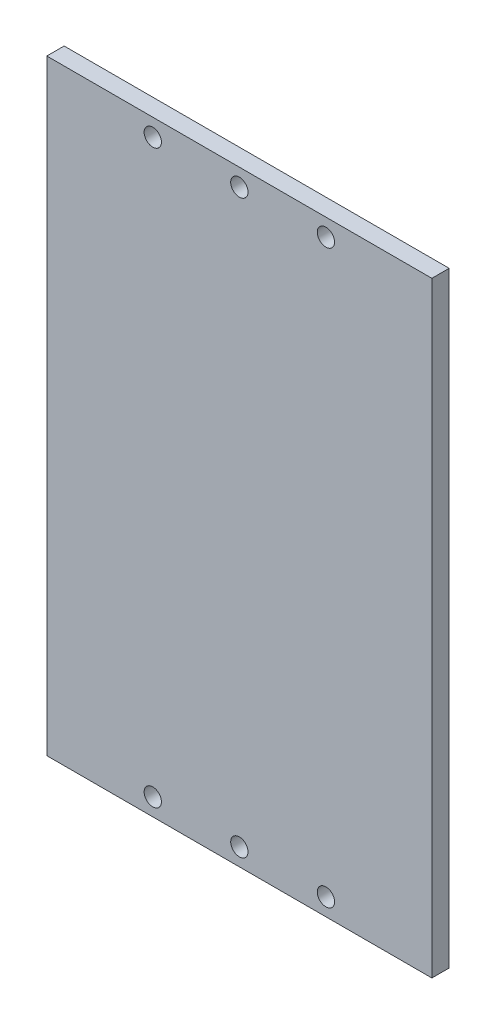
ISO-10303-21;
HEADER;
FILE_DESCRIPTION(('STEP AP214'),'2;1');
FILE_NAME('part.step','',(''),(''),'','','');
FILE_SCHEMA(('AUTOMOTIVE_DESIGN { 1 0 10303 214 1 1 1 1 }'));
ENDSEC;
DATA;
#1=APPLICATION_CONTEXT('core data for automotive mechanical design processes');
#2=APPLICATION_PROTOCOL_DEFINITION('international standard','automotive_design',2000,#1);
#3=PRODUCT_CONTEXT('',#1,'mechanical');
#4=PRODUCT('Part','Part','',(#3));
#5=PRODUCT_RELATED_PRODUCT_CATEGORY('part','',(#4));
#6=PRODUCT_DEFINITION_FORMATION('','',#4);
#7=PRODUCT_DEFINITION_CONTEXT('part definition',#1,'design');
#8=PRODUCT_DEFINITION('design','',#6,#7);
#9=PRODUCT_DEFINITION_SHAPE('','',#8);
#10=(LENGTH_UNIT() NAMED_UNIT(*) SI_UNIT(.MILLI.,.METRE.));
#11=(NAMED_UNIT(*) PLANE_ANGLE_UNIT() SI_UNIT($,.RADIAN.));
#12=(NAMED_UNIT(*) SI_UNIT($,.STERADIAN.) SOLID_ANGLE_UNIT());
#13=UNCERTAINTY_MEASURE_WITH_UNIT(LENGTH_MEASURE(1.E-05),#10,'distance_accuracy_value','');
#14=(GEOMETRIC_REPRESENTATION_CONTEXT(3) GLOBAL_UNCERTAINTY_ASSIGNED_CONTEXT((#13)) GLOBAL_UNIT_ASSIGNED_CONTEXT((#10,
#11,#12)) REPRESENTATION_CONTEXT('',''));
#15=CARTESIAN_POINT('',(0.,0.,0.));
#16=DIRECTION('',(0.,0.,1.));
#17=DIRECTION('',(1.,0.,0.));
#18=AXIS2_PLACEMENT_3D('',#15,#16,#17);
#19=CARTESIAN_POINT('',(0.,0.,2.));
#20=DIRECTION('',(0.,0.,1.));
#21=DIRECTION('',(1.,0.,0.));
#22=AXIS2_PLACEMENT_3D('',#19,#20,#21);
#23=PLANE('',#22);
#24=CARTESIAN_POINT('',(-8.26999999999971,3.00000000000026,2.));
#25=DIRECTION('',(0.,0.,1.));
#26=DIRECTION('',(-1.,0.,0.));
#27=AXIS2_PLACEMENT_3D('',#24,#25,#26);
#28=CIRCLE('',#27,1.);
#29=CARTESIAN_POINT('',(-9.26999999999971,3.00000000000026,2.));
#30=VERTEX_POINT('',#29);
#31=EDGE_CURVE('E164',#30,#30,#28,.T.);
#32=ORIENTED_EDGE('',*,*,#31,.F.);
#33=EDGE_LOOP('',(#32));
#34=FACE_BOUND('',#33,.T.);
#35=CARTESIAN_POINT('',(-18.2699999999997,-62.9999999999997,2.));
#36=DIRECTION('',(0.,0.,1.));
#37=DIRECTION('',(1.,0.,0.));
#38=AXIS2_PLACEMENT_3D('',#35,#36,#37);
#39=CIRCLE('',#38,1.);
#40=CARTESIAN_POINT('',(-17.2699999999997,-62.9999999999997,2.));
#41=VERTEX_POINT('',#40);
#42=EDGE_CURVE('E148',#41,#41,#39,.T.);
#43=ORIENTED_EDGE('',*,*,#42,.F.);
#44=EDGE_LOOP('',(#43));
#45=FACE_BOUND('',#44,.T.);
#46=CARTESIAN_POINT('',(-8.26999999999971,-62.9999999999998,2.));
#47=DIRECTION('',(0.,0.,1.));
#48=DIRECTION('',(1.,0.,0.));
#49=AXIS2_PLACEMENT_3D('',#46,#47,#48);
#50=CIRCLE('',#49,1.);
#51=CARTESIAN_POINT('',(-7.26999999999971,-62.9999999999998,2.));
#52=VERTEX_POINT('',#51);
#53=EDGE_CURVE('E118',#52,#52,#50,.T.);
#54=ORIENTED_EDGE('',*,*,#53,.F.);
#55=EDGE_LOOP('',(#54));
#56=FACE_BOUND('',#55,.T.);
#57=DIRECTION('',(0.,-1.,0.));
#58=VECTOR('',#57,1.);
#59=CARTESIAN_POINT('',(-30.5099999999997,5.00000000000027,2.));
#60=LINE('',#59,#58);
#61=CARTESIAN_POINT('',(-30.5099999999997,5.00000000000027,2.));
#62=VERTEX_POINT('',#61);
#63=CARTESIAN_POINT('',(-30.5099999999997,-64.9999999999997,2.));
#64=VERTEX_POINT('',#63);
#65=EDGE_CURVE('E98',#62,#64,#60,.T.);
#66=ORIENTED_EDGE('',*,*,#65,.T.);
#67=DIRECTION('',(1.,0.,0.));
#68=VECTOR('',#67,1.);
#69=CARTESIAN_POINT('',(-30.5099999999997,-64.9999999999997,2.));
#70=LINE('',#69,#68);
#71=CARTESIAN_POINT('',(13.9700000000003,-64.9999999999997,2.));
#72=VERTEX_POINT('',#71);
#73=EDGE_CURVE('E93',#64,#72,#70,.T.);
#74=ORIENTED_EDGE('',*,*,#73,.T.);
#75=DIRECTION('',(0.,1.,0.));
#76=VECTOR('',#75,1.);
#77=CARTESIAN_POINT('',(13.9700000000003,5.00000000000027,2.));
#78=LINE('',#77,#76);
#79=CARTESIAN_POINT('',(13.9700000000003,5.00000000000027,2.));
#80=VERTEX_POINT('',#79);
#81=EDGE_CURVE('E96',#72,#80,#78,.T.);
#82=ORIENTED_EDGE('',*,*,#81,.T.);
#83=DIRECTION('',(-1.,0.,0.));
#84=VECTOR('',#83,1.);
#85=CARTESIAN_POINT('',(-30.5099999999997,5.00000000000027,2.));
#86=LINE('',#85,#84);
#87=EDGE_CURVE('E63',#80,#62,#86,.T.);
#88=ORIENTED_EDGE('',*,*,#87,.T.);
#89=EDGE_LOOP('',(#66,#74,#82,#88));
#90=FACE_BOUND('',#89,.T.);
#91=CARTESIAN_POINT('',(1.73000000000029,-62.9999999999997,2.));
#92=DIRECTION('',(0.,0.,1.));
#93=DIRECTION('',(1.,0.,0.));
#94=AXIS2_PLACEMENT_3D('',#91,#92,#93);
#95=CIRCLE('',#94,1.);
#96=CARTESIAN_POINT('',(2.73000000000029,-62.9999999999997,2.));
#97=VERTEX_POINT('',#96);
#98=EDGE_CURVE('E140',#97,#97,#95,.T.);
#99=ORIENTED_EDGE('',*,*,#98,.F.);
#100=EDGE_LOOP('',(#99));
#101=FACE_BOUND('',#100,.T.);
#102=CARTESIAN_POINT('',(1.73000000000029,3.00000000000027,2.));
#103=DIRECTION('',(0.,0.,1.));
#104=DIRECTION('',(-1.,0.,0.));
#105=AXIS2_PLACEMENT_3D('',#102,#103,#104);
#106=CIRCLE('',#105,1.);
#107=CARTESIAN_POINT('',(0.730000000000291,3.00000000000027,2.));
#108=VERTEX_POINT('',#107);
#109=EDGE_CURVE('E156',#108,#108,#106,.T.);
#110=ORIENTED_EDGE('',*,*,#109,.F.);
#111=EDGE_LOOP('',(#110));
#112=FACE_BOUND('',#111,.T.);
#113=CARTESIAN_POINT('',(-18.2699999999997,3.00000000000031,2.));
#114=DIRECTION('',(0.,0.,1.));
#115=DIRECTION('',(-1.,0.,0.));
#116=AXIS2_PLACEMENT_3D('',#113,#114,#115);
#117=CIRCLE('',#116,1.);
#118=CARTESIAN_POINT('',(-19.2699999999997,3.00000000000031,2.));
#119=VERTEX_POINT('',#118);
#120=EDGE_CURVE('E172',#119,#119,#117,.T.);
#121=ORIENTED_EDGE('',*,*,#120,.F.);
#122=EDGE_LOOP('',(#121));
#123=FACE_BOUND('',#122,.T.);
#124=ADVANCED_FACE('F45',(#34,#45,#56,#90,#101,#112,#123),#23,.T.);
#125=CARTESIAN_POINT('',(0.,0.,0.));
#126=DIRECTION('',(0.,0.,1.));
#127=DIRECTION('',(1.,0.,0.));
#128=AXIS2_PLACEMENT_3D('',#125,#126,#127);
#129=PLANE('',#128);
#130=DIRECTION('',(0.,-1.,0.));
#131=VECTOR('',#130,1.);
#132=CARTESIAN_POINT('',(-30.5099999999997,5.00000000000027,0.));
#133=LINE('',#132,#131);
#134=CARTESIAN_POINT('',(-30.5099999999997,5.00000000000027,0.));
#135=VERTEX_POINT('',#134);
#136=CARTESIAN_POINT('',(-30.5099999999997,-64.9999999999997,0.));
#137=VERTEX_POINT('',#136);
#138=EDGE_CURVE('E114',#135,#137,#133,.T.);
#139=ORIENTED_EDGE('',*,*,#138,.F.);
#140=DIRECTION('',(-1.,0.,0.));
#141=VECTOR('',#140,1.);
#142=CARTESIAN_POINT('',(-30.5099999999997,5.00000000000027,0.));
#143=LINE('',#142,#141);
#144=CARTESIAN_POINT('',(13.9700000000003,5.00000000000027,0.));
#145=VERTEX_POINT('',#144);
#146=EDGE_CURVE('E86',#145,#135,#143,.T.);
#147=ORIENTED_EDGE('',*,*,#146,.F.);
#148=DIRECTION('',(0.,1.,0.));
#149=VECTOR('',#148,1.);
#150=CARTESIAN_POINT('',(13.9700000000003,5.00000000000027,0.));
#151=LINE('',#150,#149);
#152=CARTESIAN_POINT('',(13.9700000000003,-64.9999999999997,0.));
#153=VERTEX_POINT('',#152);
#154=EDGE_CURVE('E80',#153,#145,#151,.T.);
#155=ORIENTED_EDGE('',*,*,#154,.F.);
#156=DIRECTION('',(1.,0.,0.));
#157=VECTOR('',#156,1.);
#158=CARTESIAN_POINT('',(-30.5099999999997,-64.9999999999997,0.));
#159=LINE('',#158,#157);
#160=EDGE_CURVE('E103',#137,#153,#159,.T.);
#161=ORIENTED_EDGE('',*,*,#160,.F.);
#162=EDGE_LOOP('',(#139,#147,#155,#161));
#163=FACE_BOUND('',#162,.T.);
#164=CARTESIAN_POINT('',(-8.26999999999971,-62.9999999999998,0.));
#165=DIRECTION('',(0.,0.,1.));
#166=DIRECTION('',(1.,0.,0.));
#167=AXIS2_PLACEMENT_3D('',#164,#165,#166);
#168=CIRCLE('',#167,1.);
#169=CARTESIAN_POINT('',(-7.26999999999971,-62.9999999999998,0.));
#170=VERTEX_POINT('',#169);
#171=EDGE_CURVE('E136',#170,#170,#168,.T.);
#172=ORIENTED_EDGE('',*,*,#171,.T.);
#173=EDGE_LOOP('',(#172));
#174=FACE_BOUND('',#173,.T.);
#175=CARTESIAN_POINT('',(1.73000000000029,-62.9999999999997,0.));
#176=DIRECTION('',(0.,0.,1.));
#177=DIRECTION('',(1.,0.,0.));
#178=AXIS2_PLACEMENT_3D('',#175,#176,#177);
#179=CIRCLE('',#178,1.);
#180=CARTESIAN_POINT('',(2.73000000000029,-62.9999999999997,0.));
#181=VERTEX_POINT('',#180);
#182=EDGE_CURVE('E144',#181,#181,#179,.T.);
#183=ORIENTED_EDGE('',*,*,#182,.T.);
#184=EDGE_LOOP('',(#183));
#185=FACE_BOUND('',#184,.T.);
#186=CARTESIAN_POINT('',(-18.2699999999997,-62.9999999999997,0.));
#187=DIRECTION('',(0.,0.,1.));
#188=DIRECTION('',(1.,0.,0.));
#189=AXIS2_PLACEMENT_3D('',#186,#187,#188);
#190=CIRCLE('',#189,1.);
#191=CARTESIAN_POINT('',(-17.2699999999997,-62.9999999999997,0.));
#192=VERTEX_POINT('',#191);
#193=EDGE_CURVE('E152',#192,#192,#190,.T.);
#194=ORIENTED_EDGE('',*,*,#193,.T.);
#195=EDGE_LOOP('',(#194));
#196=FACE_BOUND('',#195,.T.);
#197=CARTESIAN_POINT('',(1.73000000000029,3.00000000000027,0.));
#198=DIRECTION('',(0.,0.,1.));
#199=DIRECTION('',(-1.,0.,0.));
#200=AXIS2_PLACEMENT_3D('',#197,#198,#199);
#201=CIRCLE('',#200,1.);
#202=CARTESIAN_POINT('',(0.730000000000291,3.00000000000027,0.));
#203=VERTEX_POINT('',#202);
#204=EDGE_CURVE('E160',#203,#203,#201,.T.);
#205=ORIENTED_EDGE('',*,*,#204,.T.);
#206=EDGE_LOOP('',(#205));
#207=FACE_BOUND('',#206,.T.);
#208=CARTESIAN_POINT('',(-8.26999999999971,3.00000000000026,0.));
#209=DIRECTION('',(0.,0.,1.));
#210=DIRECTION('',(-1.,0.,0.));
#211=AXIS2_PLACEMENT_3D('',#208,#209,#210);
#212=CIRCLE('',#211,1.);
#213=CARTESIAN_POINT('',(-9.26999999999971,3.00000000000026,0.));
#214=VERTEX_POINT('',#213);
#215=EDGE_CURVE('E168',#214,#214,#212,.T.);
#216=ORIENTED_EDGE('',*,*,#215,.T.);
#217=EDGE_LOOP('',(#216));
#218=FACE_BOUND('',#217,.T.);
#219=CARTESIAN_POINT('',(-18.2699999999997,3.00000000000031,0.));
#220=DIRECTION('',(0.,0.,1.));
#221=DIRECTION('',(-1.,0.,0.));
#222=AXIS2_PLACEMENT_3D('',#219,#220,#221);
#223=CIRCLE('',#222,1.);
#224=CARTESIAN_POINT('',(-19.2699999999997,3.00000000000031,0.));
#225=VERTEX_POINT('',#224);
#226=EDGE_CURVE('E176',#225,#225,#223,.T.);
#227=ORIENTED_EDGE('',*,*,#226,.T.);
#228=EDGE_LOOP('',(#227));
#229=FACE_BOUND('',#228,.T.);
#230=ADVANCED_FACE('F131',(#163,#174,#185,#196,#207,#218,#229),#129,.F.);
#231=CARTESIAN_POINT('',(-30.5099999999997,5.00000000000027,2.));
#232=DIRECTION('',(1.,0.,0.));
#233=DIRECTION('',(0.,1.,0.));
#234=AXIS2_PLACEMENT_3D('',#231,#232,#233);
#235=PLANE('',#234);
#236=ORIENTED_EDGE('',*,*,#138,.T.);
#237=DIRECTION('',(0.,0.,-1.));
#238=VECTOR('',#237,1.);
#239=CARTESIAN_POINT('',(-30.5099999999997,-64.9999999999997,2.));
#240=LINE('',#239,#238);
#241=EDGE_CURVE('E11',#64,#137,#240,.T.);
#242=ORIENTED_EDGE('',*,*,#241,.F.);
#243=ORIENTED_EDGE('',*,*,#65,.F.);
#244=DIRECTION('',(0.,0.,-1.));
#245=VECTOR('',#244,1.);
#246=CARTESIAN_POINT('',(-30.5099999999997,5.00000000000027,2.));
#247=LINE('',#246,#245);
#248=EDGE_CURVE('E110',#62,#135,#247,.T.);
#249=ORIENTED_EDGE('',*,*,#248,.T.);
#250=EDGE_LOOP('',(#236,#242,#243,#249));
#251=FACE_BOUND('',#250,.T.);
#252=ADVANCED_FACE('F47',(#251),#235,.F.);
#253=CARTESIAN_POINT('',(-30.5099999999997,-64.9999999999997,2.));
#254=DIRECTION('',(0.,1.,0.));
#255=DIRECTION('',(0.,0.,1.));
#256=AXIS2_PLACEMENT_3D('',#253,#254,#255);
#257=PLANE('',#256);
#258=ORIENTED_EDGE('',*,*,#160,.T.);
#259=DIRECTION('',(0.,0.,-1.));
#260=VECTOR('',#259,1.);
#261=CARTESIAN_POINT('',(13.9700000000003,-64.9999999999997,2.));
#262=LINE('',#261,#260);
#263=EDGE_CURVE('E55',#72,#153,#262,.T.);
#264=ORIENTED_EDGE('',*,*,#263,.F.);
#265=ORIENTED_EDGE('',*,*,#73,.F.);
#266=ORIENTED_EDGE('',*,*,#241,.T.);
#267=EDGE_LOOP('',(#258,#264,#265,#266));
#268=FACE_BOUND('',#267,.T.);
#269=ADVANCED_FACE('F102',(#268),#257,.F.);
#270=CARTESIAN_POINT('',(13.9700000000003,5.00000000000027,2.));
#271=DIRECTION('',(-1.,0.,0.));
#272=DIRECTION('',(0.,-1.,0.));
#273=AXIS2_PLACEMENT_3D('',#270,#271,#272);
#274=PLANE('',#273);
#275=ORIENTED_EDGE('',*,*,#154,.T.);
#276=DIRECTION('',(0.,0.,-1.));
#277=VECTOR('',#276,1.);
#278=CARTESIAN_POINT('',(13.9700000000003,5.00000000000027,2.));
#279=LINE('',#278,#277);
#280=EDGE_CURVE('E105',#80,#145,#279,.T.);
#281=ORIENTED_EDGE('',*,*,#280,.F.);
#282=ORIENTED_EDGE('',*,*,#81,.F.);
#283=ORIENTED_EDGE('',*,*,#263,.T.);
#284=EDGE_LOOP('',(#275,#281,#282,#283));
#285=FACE_BOUND('',#284,.T.);
#286=ADVANCED_FACE('F106',(#285),#274,.F.);
#287=CARTESIAN_POINT('',(-30.5099999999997,5.00000000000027,2.));
#288=DIRECTION('',(0.,-1.,0.));
#289=DIRECTION('',(0.,0.,-1.));
#290=AXIS2_PLACEMENT_3D('',#287,#288,#289);
#291=PLANE('',#290);
#292=ORIENTED_EDGE('',*,*,#146,.T.);
#293=ORIENTED_EDGE('',*,*,#248,.F.);
#294=ORIENTED_EDGE('',*,*,#87,.F.);
#295=ORIENTED_EDGE('',*,*,#280,.T.);
#296=EDGE_LOOP('',(#292,#293,#294,#295));
#297=FACE_BOUND('',#296,.T.);
#298=ADVANCED_FACE('F128',(#297),#291,.F.);
#299=CARTESIAN_POINT('',(-8.26999999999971,-62.9999999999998,2.));
#300=DIRECTION('',(0.,0.,-1.));
#301=DIRECTION('',(-1.,0.,0.));
#302=AXIS2_PLACEMENT_3D('',#299,#300,#301);
#303=CYLINDRICAL_SURFACE('',#302,1.);
#304=ORIENTED_EDGE('',*,*,#53,.T.);
#305=EDGE_LOOP('',(#304));
#306=FACE_BOUND('',#305,.T.);
#307=ORIENTED_EDGE('',*,*,#171,.F.);
#308=EDGE_LOOP('',(#307));
#309=FACE_BOUND('',#308,.T.);
#310=ADVANCED_FACE('F197',(#306,#309),#303,.F.);
#311=CARTESIAN_POINT('',(1.73000000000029,-62.9999999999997,2.));
#312=DIRECTION('',(0.,0.,-1.));
#313=DIRECTION('',(-1.,0.,0.));
#314=AXIS2_PLACEMENT_3D('',#311,#312,#313);
#315=CYLINDRICAL_SURFACE('',#314,1.);
#316=ORIENTED_EDGE('',*,*,#98,.T.);
#317=EDGE_LOOP('',(#316));
#318=FACE_BOUND('',#317,.T.);
#319=ORIENTED_EDGE('',*,*,#182,.F.);
#320=EDGE_LOOP('',(#319));
#321=FACE_BOUND('',#320,.T.);
#322=ADVANCED_FACE('F242',(#318,#321),#315,.F.);
#323=CARTESIAN_POINT('',(-18.2699999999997,-62.9999999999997,2.));
#324=DIRECTION('',(0.,0.,-1.));
#325=DIRECTION('',(-1.,0.,0.));
#326=AXIS2_PLACEMENT_3D('',#323,#324,#325);
#327=CYLINDRICAL_SURFACE('',#326,1.);
#328=ORIENTED_EDGE('',*,*,#42,.T.);
#329=EDGE_LOOP('',(#328));
#330=FACE_BOUND('',#329,.T.);
#331=ORIENTED_EDGE('',*,*,#193,.F.);
#332=EDGE_LOOP('',(#331));
#333=FACE_BOUND('',#332,.T.);
#334=ADVANCED_FACE('F250',(#330,#333),#327,.F.);
#335=CARTESIAN_POINT('',(1.73000000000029,3.00000000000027,2.));
#336=DIRECTION('',(0.,0.,-1.));
#337=DIRECTION('',(-1.,0.,0.));
#338=AXIS2_PLACEMENT_3D('',#335,#336,#337);
#339=CYLINDRICAL_SURFACE('',#338,1.);
#340=ORIENTED_EDGE('',*,*,#109,.T.);
#341=EDGE_LOOP('',(#340));
#342=FACE_BOUND('',#341,.T.);
#343=ORIENTED_EDGE('',*,*,#204,.F.);
#344=EDGE_LOOP('',(#343));
#345=FACE_BOUND('',#344,.T.);
#346=ADVANCED_FACE('F258',(#342,#345),#339,.F.);
#347=CARTESIAN_POINT('',(-8.26999999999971,3.00000000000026,2.));
#348=DIRECTION('',(0.,0.,-1.));
#349=DIRECTION('',(-1.,0.,0.));
#350=AXIS2_PLACEMENT_3D('',#347,#348,#349);
#351=CYLINDRICAL_SURFACE('',#350,1.);
#352=ORIENTED_EDGE('',*,*,#31,.T.);
#353=EDGE_LOOP('',(#352));
#354=FACE_BOUND('',#353,.T.);
#355=ORIENTED_EDGE('',*,*,#215,.F.);
#356=EDGE_LOOP('',(#355));
#357=FACE_BOUND('',#356,.T.);
#358=ADVANCED_FACE('F267',(#354,#357),#351,.F.);
#359=CARTESIAN_POINT('',(-18.2699999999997,3.00000000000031,2.));
#360=DIRECTION('',(0.,0.,-1.));
#361=DIRECTION('',(-1.,0.,0.));
#362=AXIS2_PLACEMENT_3D('',#359,#360,#361);
#363=CYLINDRICAL_SURFACE('',#362,1.);
#364=ORIENTED_EDGE('',*,*,#120,.T.);
#365=EDGE_LOOP('',(#364));
#366=FACE_BOUND('',#365,.T.);
#367=ORIENTED_EDGE('',*,*,#226,.F.);
#368=EDGE_LOOP('',(#367));
#369=FACE_BOUND('',#368,.T.);
#370=ADVANCED_FACE('F184',(#366,#369),#363,.F.);
#371=CLOSED_SHELL('',(#124,#230,#252,#269,#286,#298,#310,#322,#334,#346,#358,#370));
#372=MANIFOLD_SOLID_BREP('B2',#371);
#373=ADVANCED_BREP_SHAPE_REPRESENTATION('',(#18,#372),#14);
#374=SHAPE_DEFINITION_REPRESENTATION(#9,#373);
ENDSEC;
END-ISO-10303-21;
